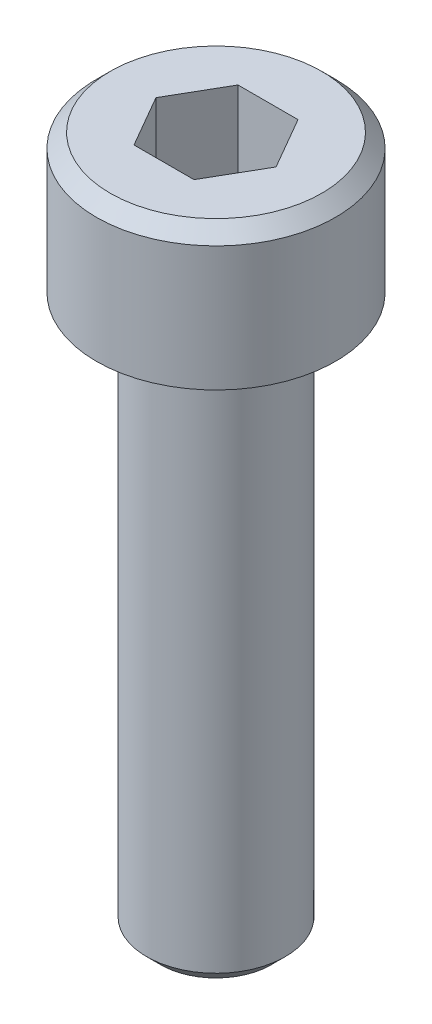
from build123d import *

# Parameters (mm, degrees)
ENL_V_MAT_EXTRU_1_DEPTH = 2.5
CHANFREIN1_SIZE         = 0.4


with BuildPart() as part:
    # Esquisse1 → R_volution1 (revolve)
    with BuildSketch(Plane.XY, mode=Mode.PRIVATE) as r_volution1_sk:
        Polygon((0, 0), (2, 0), (2, 16), (3.45, 16), (3.45, 20), (0, 20), align=None)
    revolve(r_volution1_sk.sketch.rotate(Axis((0, 0, 0), (0, 1, 0)), 90), axis=Axis((0, 0, 0), (0, 1, 0)))

    # Esquisse2 → Enl_v. mat.-Extru.1 (cut)
    with BuildSketch(Plane(origin=(0, 20, 0), x_dir=(-1, 0, 0), z_dir=(0, 1, 0))):
        Polygon((-0.866025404, -1.5), (0.866025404, -1.5), (1.732050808, 0), (0.866025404, 1.5), (-0.866025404, 1.5), (-1.732050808, 0), align=None)
    extrude(amount=-ENL_V_MAT_EXTRU_1_DEPTH, mode=Mode.SUBTRACT)

    # Chanfrein1
    chanfrein1_edges = [part.edges().sort_by_distance(p)[0] for p in [
        (0, 20, 3.45),
        (0, 0, 2),
    ]]
    chamfer(chanfrein1_edges, length=CHANFREIN1_SIZE)


solid = part.part
